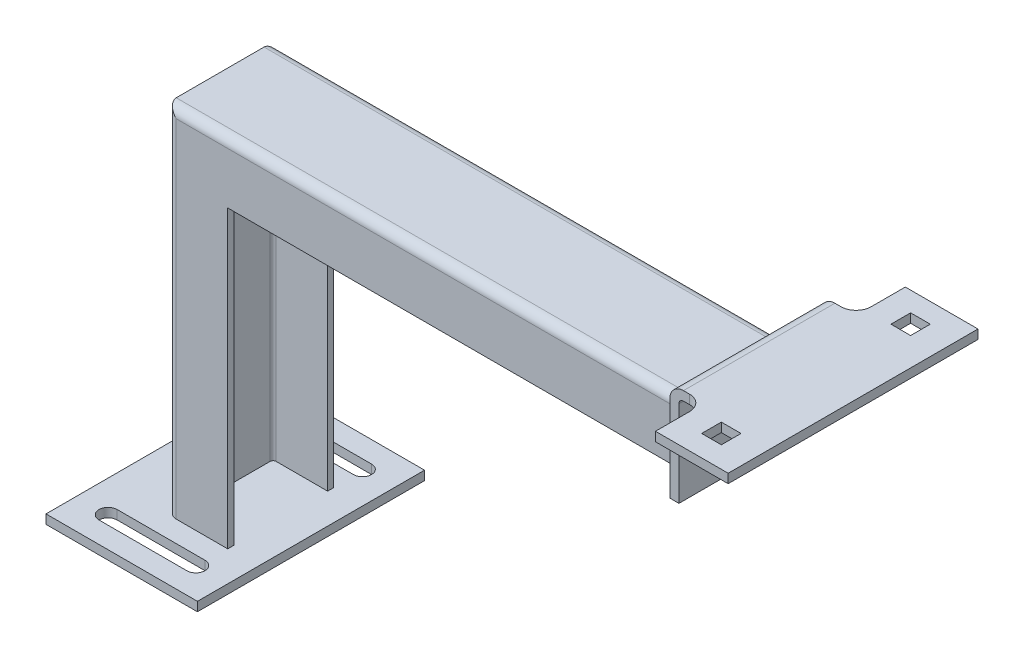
from build123d import *

# Parameters (mm, degrees)
ESQUISSE1_W             = 450
ESQUISSE1_H             = 235
BASE_EXTRUSION_DEPTH    = 70
ESQUISSE6_OUTSIDE_W     = 554.494
ESQUISSE6_OUTSIDE_H     = 339.494
ENL_V_MAT_EXTRU_2_DEPTH = 270.118932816
ENL_V_MAT_EXTRU_3_DEPTH = 62
ESQUISSE9_W             = 100
ESQUISSE9_H             = 150
BOSS_EXTRU_4_DEPTH      = 6
ESQUISSE11_W            = 100
ESQUISSE11_H            = 66
ESQUISSE11_W_2          = 13
ESQUISSE11_H_2          = 13
BOSS_EXTRU_5_DEPTH      = 6
ESQUISSE12_W            = 165
ESQUISSE12_H            = 6
BOSS_EXTRU_6_DEPTH      = 65
ESQUISSE13_W            = 13
ESQUISSE13_H            = 13
ENL_V_MAT_EXTRU_5_DEPTH = 6
CONG_1_R                = 6
CONG_2_R                = 2
CONG_3_R                = 3
CONG_4_R                = 9


with BuildPart() as part:
    # Esquisse1 → Base-Extrusion (new body)
    with BuildSketch(Plane.XY):
        with Locations((0, -12.5)):
            Rectangle(ESQUISSE1_W, ESQUISSE1_H)
    extrude(amount=BASE_EXTRUSION_DEPTH)

    # Esquisse6 outside → Enl_v. mat.-Extru.2 (cut, through all)
    with BuildSketch(Plane.XY.offset(70)):
        with Locations((0, -12.5)):
            Rectangle(ESQUISSE6_OUTSIDE_W, ESQUISSE6_OUTSIDE_H)
        Polygon((-122.001, -130), (-122.001, 105), (224.999, 105), (224.999, 65), (-82.001, 65), (-82.001, -130), align=None, mode=Mode.SUBTRACT)
    extrude(amount=-ENL_V_MAT_EXTRU_2_DEPTH, mode=Mode.SUBTRACT)

    # Esquisse8 → Enl_v. mat.-Extru.3 (cut)
    with BuildSketch(Plane.XY.offset(4)):
        Polygon((-118.001, 101), (-118.001, -149.148732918), (-82.001, -149.148732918), (-82.001, 65), (224.999, 65), (224.999, 101), align=None)
    extrude(amount=ENL_V_MAT_EXTRU_3_DEPTH, mode=Mode.SUBTRACT)

    # Esquisse9 → Boss.-Extru.4 (add)
    with BuildSketch(Plane.XZ.offset(130)):
        with Locations((-112.001, 35)):
            Rectangle(ESQUISSE9_W, ESQUISSE9_H)
        with BuildLine():
            Line((-141.001, 84), (-83.001, 84))
            ThreePointArc((-83.001, 84), (-77.001, 90), (-83.001, 96))
            Line((-83.001, 96), (-141.001, 96))
            ThreePointArc((-141.001, 96), (-147.001, 90), (-141.001, 84))
        make_face(mode=Mode.SUBTRACT)
        with BuildLine():
            Line((-141.001, -14), (-83.001, -14))
            ThreePointArc((-83.001, -14), (-77.001, -20), (-83.001, -26))
            Line((-83.001, -26), (-141.001, -26))
            ThreePointArc((-141.001, -26), (-147.001, -20), (-141.001, -14))
        make_face(mode=Mode.SUBTRACT)
    extrude(amount=BOSS_EXTRU_4_DEPTH)

    # Esquisse11 → Boss.-Extru.5 (add)
    with BuildSketch(Plane(origin=(224.999, 0, 0), x_dir=(0, 0, -1), z_dir=(1, 0, 0))):
        with Locations((-35, 93)):
            Rectangle(ESQUISSE11_W, ESQUISSE11_H)
        with Locations((-35.5, 85.5)):
            Rectangle(ESQUISSE11_W_2, ESQUISSE11_H_2, mode=Mode.SUBTRACT)
    extrude(amount=BOSS_EXTRU_5_DEPTH)

    # Esquisse12 → Boss.-Extru.6 (add)
    with BuildSketch(Plane(origin=(230.999, 0, 0), x_dir=(0, 0, -1), z_dir=(1, 0, 0))):
        with Locations((-35, 123)):
            Rectangle(ESQUISSE12_W, ESQUISSE12_H)
    extrude(amount=BOSS_EXTRU_6_DEPTH)

    # Esquisse13 → Enl_v. mat.-Extru.5 (cut)
    with BuildSketch(Plane(origin=(0, 126, 0), x_dir=(-1, 0, 0), z_dir=(0, 1, 0))):
        with BuildLine():
            Line((-247.999, -47.5), (-247.999, -25))
            ThreePointArc((-247.999, -25), (-245.070067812, -17.928932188), (-237.999, -15))
            Line((-237.999, -15), (-224.999, -15))
            Line((-224.999, -15), (-224.999, -47.5))
            Line((-224.999, -47.5), (-247.999, -47.5))
        make_face()
        with BuildLine():
            Line((-224.999, 85), (-237.999, 85))
            ThreePointArc((-237.999, 85), (-245.070067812, 87.928932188), (-247.999, 95))
            Line((-247.999, 95), (-247.999, 117.5))
            Line((-247.999, 117.5), (-224.999, 117.5))
            Line((-224.999, 117.5), (-224.999, 85))
        make_face()
        with Locations((-270.999, 97)):
            Rectangle(ESQUISSE13_W, ESQUISSE13_H)
        with Locations((-270.999, -28)):
            Rectangle(ESQUISSE13_W, ESQUISSE13_H)
    extrude(amount=-ENL_V_MAT_EXTRU_5_DEPTH, mode=Mode.SUBTRACT)

    # Cong_1
    cong_1_edges = [part.edges().sort_by_distance(p)[0] for p in [
        (51.499, 105, 0),
        (51.499, 105, 70),
        (-122.001, -12.5, 0),
        (-122.001, -12.5, 70),
    ]]
    fillet(cong_1_edges, radius=CONG_1_R)

    # Cong_2
    cong_2_edges = [part.edges().sort_by_distance(p)[0] for p in [
        (-118.001, -14.5, 4),
        (53.499, 101, 66),
        (-118.001, -14.5, 66),
        (53.499, 101, 4),
    ]]
    fillet(cong_2_edges, radius=CONG_2_R)

    # Cong_3
    cong_3_edges = [part.edges().sort_by_distance(p)[0] for p in [
        (230.999, 120, 35),
    ]]
    fillet(cong_3_edges, radius=CONG_3_R)

    # Cong_4
    cong_4_edges = [part.edges().sort_by_distance(p)[0] for p in [
        (224.999, 126, 35),
    ]]
    fillet(cong_4_edges, radius=CONG_4_R)


solid = part.part
